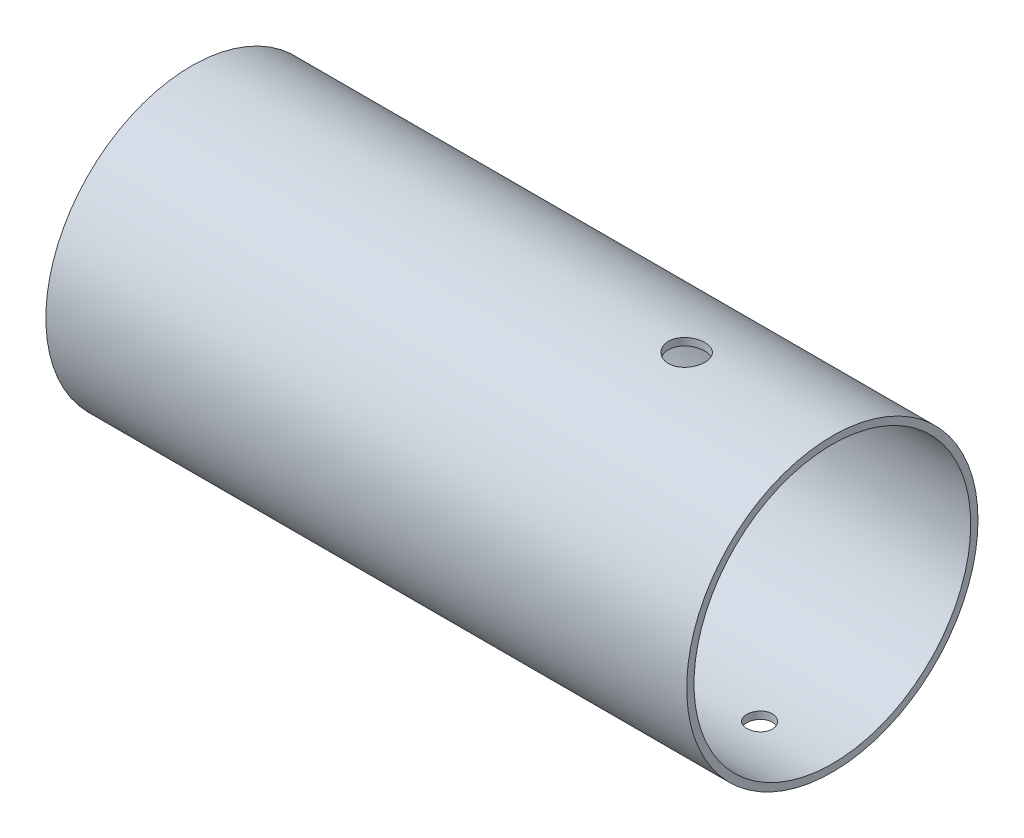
from build123d import *

# Parameters (mm, degrees)
SKETCH1_R          = 20
SKETCH1_R_2        = 19
EXTRUDE1_DEPTH     = 88
SKETCH2_R          = 1.75
CUT_EXTRUDE1_DEPTH = 88
SKETCH3_R          = 2.5
CUT_EXTRUDE2_DEPTH = 88


with BuildPart() as part:
    # Sketch1 → Extrude1 (new body)
    with BuildSketch(Plane(origin=(0, 0, 0), x_dir=(0, 0, -1), z_dir=(1, 0, 0))):
        Circle(SKETCH1_R)
        Circle(SKETCH1_R_2, mode=Mode.SUBTRACT)
    extrude(amount=EXTRUDE1_DEPTH)

    # Sketch2 → Cut-Extrude1 (cut)
    with BuildSketch(Plane(origin=(0, 0, 0), x_dir=(1, 0, 0), z_dir=(0, 1, 0))):
        with Locations(Location((10, 0, 0), (0, 0, 270))):
            Circle(SKETCH2_R)
        with Locations(Location((78, 0, 0), (0, 0, 270))):
            Circle(SKETCH2_R)
    extrude(amount=-CUT_EXTRUDE1_DEPTH, mode=Mode.SUBTRACT)

    # Sketch3 → Cut-Extrude2 (cut)
    with BuildSketch(Plane(origin=(0, 0, 0), x_dir=(1, 0, 0), z_dir=(0, 1, 0))):
        with Locations(Location((68, 0, 0), (0, 0, 90))):
            Circle(SKETCH3_R)
    extrude(amount=CUT_EXTRUDE2_DEPTH, mode=Mode.SUBTRACT)


solid = part.part
